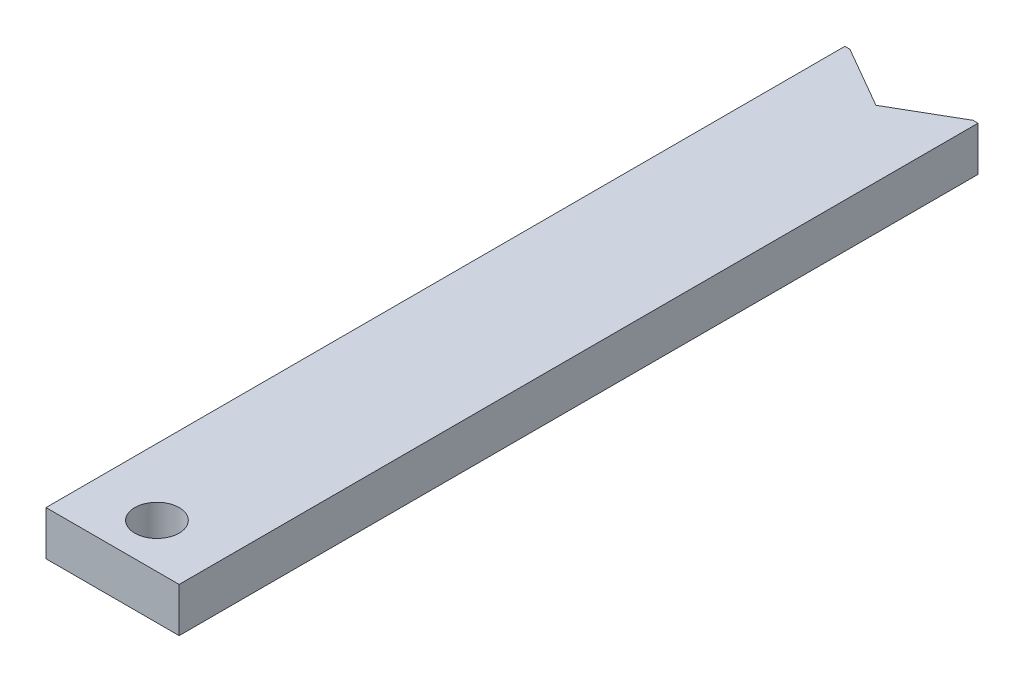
ISO-10303-21;
HEADER;
FILE_DESCRIPTION(('STEP AP214'),'2;1');
FILE_NAME('part.step','',(''),(''),'','','');
FILE_SCHEMA(('AUTOMOTIVE_DESIGN { 1 0 10303 214 1 1 1 1 }'));
ENDSEC;
DATA;
#1=APPLICATION_CONTEXT('core data for automotive mechanical design processes');
#2=APPLICATION_PROTOCOL_DEFINITION('international standard','automotive_design',2000,#1);
#3=PRODUCT_CONTEXT('',#1,'mechanical');
#4=PRODUCT('Part','Part','',(#3));
#5=PRODUCT_RELATED_PRODUCT_CATEGORY('part','',(#4));
#6=PRODUCT_DEFINITION_FORMATION('','',#4);
#7=PRODUCT_DEFINITION_CONTEXT('part definition',#1,'design');
#8=PRODUCT_DEFINITION('design','',#6,#7);
#9=PRODUCT_DEFINITION_SHAPE('','',#8);
#10=(LENGTH_UNIT() NAMED_UNIT(*) SI_UNIT(.MILLI.,.METRE.));
#11=(NAMED_UNIT(*) PLANE_ANGLE_UNIT() SI_UNIT($,.RADIAN.));
#12=(NAMED_UNIT(*) SI_UNIT($,.STERADIAN.) SOLID_ANGLE_UNIT());
#13=UNCERTAINTY_MEASURE_WITH_UNIT(LENGTH_MEASURE(1.E-05),#10,'distance_accuracy_value','');
#14=(GEOMETRIC_REPRESENTATION_CONTEXT(3) GLOBAL_UNCERTAINTY_ASSIGNED_CONTEXT((#13)) GLOBAL_UNIT_ASSIGNED_CONTEXT((#10,
#11,#12)) REPRESENTATION_CONTEXT('',''));
#15=CARTESIAN_POINT('',(0.,0.,0.));
#16=DIRECTION('',(0.,0.,1.));
#17=DIRECTION('',(1.,0.,0.));
#18=AXIS2_PLACEMENT_3D('',#15,#16,#17);
#19=CARTESIAN_POINT('',(-7.50000000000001,5.,-45.));
#20=DIRECTION('',(0.,0.,1.));
#21=DIRECTION('',(1.,0.,0.));
#22=AXIS2_PLACEMENT_3D('',#19,#20,#21);
#23=PLANE('',#22);
#24=DIRECTION('',(0.,1.,0.));
#25=VECTOR('',#24,1.);
#26=CARTESIAN_POINT('',(-6.92820323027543,0.,-45.));
#27=LINE('',#26,#25);
#28=CARTESIAN_POINT('',(-6.92820323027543,5.,-45.));
#29=VERTEX_POINT('',#28);
#30=CARTESIAN_POINT('',(-6.92820323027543,0.,-45.));
#31=VERTEX_POINT('',#30);
#32=EDGE_CURVE('E71',#29,#31,#27,.F.);
#33=ORIENTED_EDGE('',*,*,#32,.T.);
#34=DIRECTION('',(1.,0.,0.));
#35=VECTOR('',#34,1.);
#36=CARTESIAN_POINT('',(0.,0.,-45.));
#37=LINE('',#36,#35);
#38=CARTESIAN_POINT('',(-7.50000000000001,0.,-45.));
#39=VERTEX_POINT('',#38);
#40=EDGE_CURVE('E85',#31,#39,#37,.F.);
#41=ORIENTED_EDGE('',*,*,#40,.T.);
#42=DIRECTION('',(0.,1.,0.));
#43=VECTOR('',#42,1.);
#44=CARTESIAN_POINT('',(-7.50000000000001,5.,-45.));
#45=LINE('',#44,#43);
#46=CARTESIAN_POINT('',(-7.50000000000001,5.,-45.));
#47=VERTEX_POINT('',#46);
#48=EDGE_CURVE('E128',#39,#47,#45,.T.);
#49=ORIENTED_EDGE('',*,*,#48,.T.);
#50=DIRECTION('',(1.,0.,0.));
#51=VECTOR('',#50,1.);
#52=CARTESIAN_POINT('',(-7.50000000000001,5.,-45.));
#53=LINE('',#52,#51);
#54=EDGE_CURVE('E105',#29,#47,#53,.F.);
#55=ORIENTED_EDGE('',*,*,#54,.F.);
#56=EDGE_LOOP('',(#33,#41,#49,#55));
#57=FACE_BOUND('',#56,.T.);
#58=ADVANCED_FACE('F17',(#57),#23,.F.);
#59=CARTESIAN_POINT('',(-7.50000000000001,5.,-45.));
#60=DIRECTION('',(0.,0.,1.));
#61=DIRECTION('',(1.,0.,0.));
#62=AXIS2_PLACEMENT_3D('',#59,#60,#61);
#63=PLANE('',#62);
#64=DIRECTION('',(0.,1.,0.));
#65=VECTOR('',#64,1.);
#66=CARTESIAN_POINT('',(6.92820323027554,0.,-45.));
#67=LINE('',#66,#65);
#68=CARTESIAN_POINT('',(6.92820323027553,0.,-45.));
#69=VERTEX_POINT('',#68);
#70=CARTESIAN_POINT('',(6.92820323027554,5.,-45.));
#71=VERTEX_POINT('',#70);
#72=EDGE_CURVE('E79',#69,#71,#67,.T.);
#73=ORIENTED_EDGE('',*,*,#72,.T.);
#74=DIRECTION('',(1.,0.,0.));
#75=VECTOR('',#74,1.);
#76=CARTESIAN_POINT('',(-7.50000000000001,5.,-45.));
#77=LINE('',#76,#75);
#78=CARTESIAN_POINT('',(7.5,5.,-45.));
#79=VERTEX_POINT('',#78);
#80=EDGE_CURVE('E35',#79,#71,#77,.F.);
#81=ORIENTED_EDGE('',*,*,#80,.F.);
#82=DIRECTION('',(0.,1.,0.));
#83=VECTOR('',#82,1.);
#84=CARTESIAN_POINT('',(7.49999999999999,5.,-45.));
#85=LINE('',#84,#83);
#86=CARTESIAN_POINT('',(7.5,0.,-45.));
#87=VERTEX_POINT('',#86);
#88=EDGE_CURVE('E81',#79,#87,#85,.F.);
#89=ORIENTED_EDGE('',*,*,#88,.T.);
#90=DIRECTION('',(1.,0.,0.));
#91=VECTOR('',#90,1.);
#92=CARTESIAN_POINT('',(0.,0.,-45.));
#93=LINE('',#92,#91);
#94=EDGE_CURVE('E75',#87,#69,#93,.F.);
#95=ORIENTED_EDGE('',*,*,#94,.T.);
#96=EDGE_LOOP('',(#73,#81,#89,#95));
#97=FACE_BOUND('',#96,.T.);
#98=ADVANCED_FACE('F77',(#97),#63,.F.);
#99=CARTESIAN_POINT('',(0.,0.,0.));
#100=DIRECTION('',(0.,1.,0.));
#101=DIRECTION('',(0.,0.,1.));
#102=AXIS2_PLACEMENT_3D('',#99,#100,#101);
#103=PLANE('',#102);
#104=DIRECTION('',(0.866025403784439,0.,-0.499999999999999));
#105=VECTOR('',#104,1.);
#106=CARTESIAN_POINT('',(0.,0.,-41.));
#107=LINE('',#106,#105);
#108=CARTESIAN_POINT('',(0.,0.,-41.));
#109=VERTEX_POINT('',#108);
#110=EDGE_CURVE('E88',#109,#69,#107,.T.);
#111=ORIENTED_EDGE('',*,*,#110,.T.);
#112=ORIENTED_EDGE('',*,*,#94,.F.);
#113=DIRECTION('',(0.,0.,1.));
#114=VECTOR('',#113,1.);
#115=CARTESIAN_POINT('',(7.49999999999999,0.,-45.));
#116=LINE('',#115,#114);
#117=CARTESIAN_POINT('',(7.50000000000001,0.,45.));
#118=VERTEX_POINT('',#117);
#119=EDGE_CURVE('E108',#87,#118,#116,.T.);
#120=ORIENTED_EDGE('',*,*,#119,.T.);
#121=DIRECTION('',(-1.,0.,0.));
#122=VECTOR('',#121,1.);
#123=CARTESIAN_POINT('',(-7.5,0.,45.));
#124=LINE('',#123,#122);
#125=CARTESIAN_POINT('',(-7.5,0.,45.));
#126=VERTEX_POINT('',#125);
#127=EDGE_CURVE('E121',#118,#126,#124,.T.);
#128=ORIENTED_EDGE('',*,*,#127,.T.);
#129=DIRECTION('',(0.,0.,-1.));
#130=VECTOR('',#129,1.);
#131=CARTESIAN_POINT('',(-7.50000000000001,0.,-45.));
#132=LINE('',#131,#130);
#133=EDGE_CURVE('E125',#126,#39,#132,.T.);
#134=ORIENTED_EDGE('',*,*,#133,.T.);
#135=ORIENTED_EDGE('',*,*,#40,.F.);
#136=DIRECTION('',(0.866025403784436,0.,0.500000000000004));
#137=VECTOR('',#136,1.);
#138=CARTESIAN_POINT('',(-6.92820323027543,0.,-45.));
#139=LINE('',#138,#137);
#140=EDGE_CURVE('E92',#31,#109,#139,.T.);
#141=ORIENTED_EDGE('',*,*,#140,.T.);
#142=EDGE_LOOP('',(#111,#112,#120,#128,#134,#135,#141));
#143=FACE_BOUND('',#142,.T.);
#144=CARTESIAN_POINT('',(0.,0.,40.));
#145=DIRECTION('',(0.,1.,0.));
#146=DIRECTION('',(0.,0.,1.));
#147=AXIS2_PLACEMENT_3D('',#144,#145,#146);
#148=CIRCLE('',#147,2.5);
#149=CARTESIAN_POINT('',(0.,0.,42.5));
#150=VERTEX_POINT('',#149);
#151=EDGE_CURVE('E20',#150,#150,#148,.T.);
#152=ORIENTED_EDGE('',*,*,#151,.T.);
#153=EDGE_LOOP('',(#152));
#154=FACE_BOUND('',#153,.T.);
#155=ADVANCED_FACE('F89',(#143,#154),#103,.F.);
#156=CARTESIAN_POINT('',(0.,0.,40.));
#157=DIRECTION('',(0.,1.,0.));
#158=DIRECTION('',(0.,0.,1.));
#159=AXIS2_PLACEMENT_3D('',#156,#157,#158);
#160=CYLINDRICAL_SURFACE('',#159,2.5);
#161=CARTESIAN_POINT('',(0.,5.,40.));
#162=DIRECTION('',(0.,1.,0.));
#163=DIRECTION('',(0.,0.,1.));
#164=AXIS2_PLACEMENT_3D('',#161,#162,#163);
#165=CIRCLE('',#164,2.5);
#166=CARTESIAN_POINT('',(0.,5.,42.5));
#167=VERTEX_POINT('',#166);
#168=EDGE_CURVE('E106',#167,#167,#165,.F.);
#169=ORIENTED_EDGE('',*,*,#168,.F.);
#170=EDGE_LOOP('',(#169));
#171=FACE_BOUND('',#170,.T.);
#172=ORIENTED_EDGE('',*,*,#151,.F.);
#173=EDGE_LOOP('',(#172));
#174=FACE_BOUND('',#173,.T.);
#175=ADVANCED_FACE('F174',(#171,#174),#160,.F.);
#176=CARTESIAN_POINT('',(0.,0.,-41.));
#177=DIRECTION('',(0.499999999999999,0.,0.866025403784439));
#178=DIRECTION('',(0.866025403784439,0.,-0.499999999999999));
#179=AXIS2_PLACEMENT_3D('',#176,#177,#178);
#180=PLANE('',#179);
#181=ORIENTED_EDGE('',*,*,#72,.F.);
#182=ORIENTED_EDGE('',*,*,#110,.F.);
#183=DIRECTION('',(0.,1.,0.));
#184=VECTOR('',#183,1.);
#185=CARTESIAN_POINT('',(0.,0.,-41.));
#186=LINE('',#185,#184);
#187=CARTESIAN_POINT('',(0.,5.,-41.));
#188=VERTEX_POINT('',#187);
#189=EDGE_CURVE('E131',#109,#188,#186,.T.);
#190=ORIENTED_EDGE('',*,*,#189,.T.);
#191=DIRECTION('',(-0.866025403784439,0.,0.499999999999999));
#192=VECTOR('',#191,1.);
#193=CARTESIAN_POINT('',(6.92820323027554,5.,-45.));
#194=LINE('',#193,#192);
#195=EDGE_CURVE('E98',#71,#188,#194,.T.);
#196=ORIENTED_EDGE('',*,*,#195,.F.);
#197=EDGE_LOOP('',(#181,#182,#190,#196));
#198=FACE_BOUND('',#197,.T.);
#199=ADVANCED_FACE('F96',(#198),#180,.F.);
#200=CARTESIAN_POINT('',(-6.92820323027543,0.,-45.));
#201=DIRECTION('',(-0.500000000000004,0.,0.866025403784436));
#202=DIRECTION('',(0.866025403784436,0.,0.500000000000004));
#203=AXIS2_PLACEMENT_3D('',#200,#201,#202);
#204=PLANE('',#203);
#205=ORIENTED_EDGE('',*,*,#189,.F.);
#206=ORIENTED_EDGE('',*,*,#140,.F.);
#207=ORIENTED_EDGE('',*,*,#32,.F.);
#208=DIRECTION('',(-0.866025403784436,0.,-0.500000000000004));
#209=VECTOR('',#208,1.);
#210=CARTESIAN_POINT('',(0.,5.,-41.));
#211=LINE('',#210,#209);
#212=EDGE_CURVE('E111',#188,#29,#211,.T.);
#213=ORIENTED_EDGE('',*,*,#212,.F.);
#214=EDGE_LOOP('',(#205,#206,#207,#213));
#215=FACE_BOUND('',#214,.T.);
#216=ADVANCED_FACE('F135',(#215),#204,.F.);
#217=CARTESIAN_POINT('',(-7.50000000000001,5.,-45.));
#218=DIRECTION('',(1.,0.,0.));
#219=DIRECTION('',(0.,0.,-1.));
#220=AXIS2_PLACEMENT_3D('',#217,#218,#219);
#221=PLANE('',#220);
#222=DIRECTION('',(0.,1.,0.));
#223=VECTOR('',#222,1.);
#224=CARTESIAN_POINT('',(-7.5,5.,45.));
#225=LINE('',#224,#223);
#226=CARTESIAN_POINT('',(-7.5,5.,45.));
#227=VERTEX_POINT('',#226);
#228=EDGE_CURVE('E123',#126,#227,#225,.T.);
#229=ORIENTED_EDGE('',*,*,#228,.T.);
#230=DIRECTION('',(0.,0.,1.));
#231=VECTOR('',#230,1.);
#232=CARTESIAN_POINT('',(-7.50000000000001,5.,0.));
#233=LINE('',#232,#231);
#234=EDGE_CURVE('E137',#47,#227,#233,.T.);
#235=ORIENTED_EDGE('',*,*,#234,.F.);
#236=ORIENTED_EDGE('',*,*,#48,.F.);
#237=ORIENTED_EDGE('',*,*,#133,.F.);
#238=EDGE_LOOP('',(#229,#235,#236,#237));
#239=FACE_BOUND('',#238,.T.);
#240=ADVANCED_FACE('F151',(#239),#221,.F.);
#241=CARTESIAN_POINT('',(-7.5,5.,45.));
#242=DIRECTION('',(0.,0.,-1.));
#243=DIRECTION('',(-1.,0.,0.));
#244=AXIS2_PLACEMENT_3D('',#241,#242,#243);
#245=PLANE('',#244);
#246=DIRECTION('',(0.,1.,0.));
#247=VECTOR('',#246,1.);
#248=CARTESIAN_POINT('',(7.5,5.,45.));
#249=LINE('',#248,#247);
#250=CARTESIAN_POINT('',(7.50000000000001,5.,45.));
#251=VERTEX_POINT('',#250);
#252=EDGE_CURVE('E116',#118,#251,#249,.T.);
#253=ORIENTED_EDGE('',*,*,#252,.T.);
#254=DIRECTION('',(1.,0.,0.));
#255=VECTOR('',#254,1.);
#256=CARTESIAN_POINT('',(0.,5.,45.));
#257=LINE('',#256,#255);
#258=EDGE_CURVE('E26',#227,#251,#257,.T.);
#259=ORIENTED_EDGE('',*,*,#258,.F.);
#260=ORIENTED_EDGE('',*,*,#228,.F.);
#261=ORIENTED_EDGE('',*,*,#127,.F.);
#262=EDGE_LOOP('',(#253,#259,#260,#261));
#263=FACE_BOUND('',#262,.T.);
#264=ADVANCED_FACE('F146',(#263),#245,.F.);
#265=CARTESIAN_POINT('',(7.49999999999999,5.,-45.));
#266=DIRECTION('',(-1.,0.,0.));
#267=DIRECTION('',(0.,0.,1.));
#268=AXIS2_PLACEMENT_3D('',#265,#266,#267);
#269=PLANE('',#268);
#270=ORIENTED_EDGE('',*,*,#88,.F.);
#271=DIRECTION('',(0.,0.,1.));
#272=VECTOR('',#271,1.);
#273=CARTESIAN_POINT('',(7.50000000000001,5.,0.));
#274=LINE('',#273,#272);
#275=EDGE_CURVE('E11',#251,#79,#274,.F.);
#276=ORIENTED_EDGE('',*,*,#275,.F.);
#277=ORIENTED_EDGE('',*,*,#252,.F.);
#278=ORIENTED_EDGE('',*,*,#119,.F.);
#279=EDGE_LOOP('',(#270,#276,#277,#278));
#280=FACE_BOUND('',#279,.T.);
#281=ADVANCED_FACE('F144',(#280),#269,.F.);
#282=CARTESIAN_POINT('',(0.,5.,0.));
#283=DIRECTION('',(0.,1.,0.));
#284=DIRECTION('',(0.,0.,1.));
#285=AXIS2_PLACEMENT_3D('',#282,#283,#284);
#286=PLANE('',#285);
#287=ORIENTED_EDGE('',*,*,#275,.T.);
#288=ORIENTED_EDGE('',*,*,#80,.T.);
#289=ORIENTED_EDGE('',*,*,#195,.T.);
#290=ORIENTED_EDGE('',*,*,#212,.T.);
#291=ORIENTED_EDGE('',*,*,#54,.T.);
#292=ORIENTED_EDGE('',*,*,#234,.T.);
#293=ORIENTED_EDGE('',*,*,#258,.T.);
#294=EDGE_LOOP('',(#287,#288,#289,#290,#291,#292,#293));
#295=FACE_BOUND('',#294,.T.);
#296=ORIENTED_EDGE('',*,*,#168,.T.);
#297=EDGE_LOOP('',(#296));
#298=FACE_BOUND('',#297,.T.);
#299=ADVANCED_FACE('F138',(#295,#298),#286,.T.);
#300=CLOSED_SHELL('',(#58,#98,#155,#175,#199,#216,#240,#264,#281,#299));
#301=MANIFOLD_SOLID_BREP('B1',#300);
#302=ADVANCED_BREP_SHAPE_REPRESENTATION('',(#18,#301),#14);
#303=SHAPE_DEFINITION_REPRESENTATION(#9,#302);
ENDSEC;
END-ISO-10303-21;
